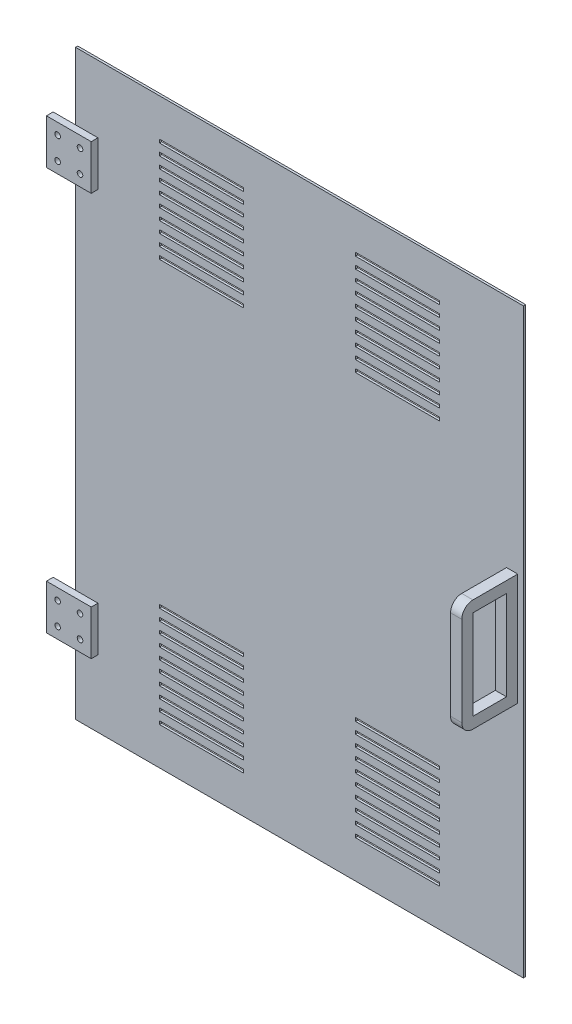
from build123d import *

# Parameters (mm, degrees)
SKETCH_1_W      = 400
SKETCH_1_H      = 520
SKETCH_1_W_2    = 75
SKETCH_1_H_2    = 3
EXTRUDE_1_DEPTH = 2
SKETCH_3_W      = 40
SKETCH_3_H      = 40
SKETCH_3_R      = 2.5
EXTRUDE_2_DEPTH = 6
SKETCH_4_W      = 30
SKETCH_4_H      = 80
EXTRUDE_3_DEPTH = 10


with BuildPart() as part:
    # Sketch 1 → Extrude 1 (new body)
    with BuildSketch(Plane.XY):
        with Locations((240, 300)):
            Rectangle(SKETCH_1_W, SKETCH_1_H)
        with Locations((327.5, 524.938797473)):
            Rectangle(SKETCH_1_W_2, SKETCH_1_H_2, mode=Mode.SUBTRACT)
        with Locations((152.5, 524.938797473)):
            Rectangle(SKETCH_1_W_2, SKETCH_1_H_2, mode=Mode.SUBTRACT)
        with Locations((152.5, 514.938797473)):
            Rectangle(SKETCH_1_W_2, SKETCH_1_H_2, mode=Mode.SUBTRACT)
        with Locations((327.5, 514.938797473)):
            Rectangle(SKETCH_1_W_2, SKETCH_1_H_2, mode=Mode.SUBTRACT)
        with Locations((152.5, 504.938797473)):
            Rectangle(SKETCH_1_W_2, SKETCH_1_H_2, mode=Mode.SUBTRACT)
        with Locations((327.5, 504.938797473)):
            Rectangle(SKETCH_1_W_2, SKETCH_1_H_2, mode=Mode.SUBTRACT)
        with Locations((152.5, 494.938797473)):
            Rectangle(SKETCH_1_W_2, SKETCH_1_H_2, mode=Mode.SUBTRACT)
        with Locations((327.5, 494.938797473)):
            Rectangle(SKETCH_1_W_2, SKETCH_1_H_2, mode=Mode.SUBTRACT)
        with Locations((152.5, 484.938797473)):
            Rectangle(SKETCH_1_W_2, SKETCH_1_H_2, mode=Mode.SUBTRACT)
        with Locations((327.5, 484.938797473)):
            Rectangle(SKETCH_1_W_2, SKETCH_1_H_2, mode=Mode.SUBTRACT)
        with Locations((152.5, 474.938797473)):
            Rectangle(SKETCH_1_W_2, SKETCH_1_H_2, mode=Mode.SUBTRACT)
        with Locations((327.5, 474.938797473)):
            Rectangle(SKETCH_1_W_2, SKETCH_1_H_2, mode=Mode.SUBTRACT)
        with Locations((152.5, 464.938797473)):
            Rectangle(SKETCH_1_W_2, SKETCH_1_H_2, mode=Mode.SUBTRACT)
        with Locations((327.5, 464.938797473)):
            Rectangle(SKETCH_1_W_2, SKETCH_1_H_2, mode=Mode.SUBTRACT)
        with Locations((152.5, 454.938797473)):
            Rectangle(SKETCH_1_W_2, SKETCH_1_H_2, mode=Mode.SUBTRACT)
        with Locations((327.5, 454.938797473)):
            Rectangle(SKETCH_1_W_2, SKETCH_1_H_2, mode=Mode.SUBTRACT)
        with Locations((152.5, 444.938797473)):
            Rectangle(SKETCH_1_W_2, SKETCH_1_H_2, mode=Mode.SUBTRACT)
        with Locations((327.5, 444.938797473)):
            Rectangle(SKETCH_1_W_2, SKETCH_1_H_2, mode=Mode.SUBTRACT)
        with Locations((152.5, 434.938797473)):
            Rectangle(SKETCH_1_W_2, SKETCH_1_H_2, mode=Mode.SUBTRACT)
        with Locations((327.5, 434.938797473)):
            Rectangle(SKETCH_1_W_2, SKETCH_1_H_2, mode=Mode.SUBTRACT)
        with Locations((327.5, 165.061202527)):
            Rectangle(SKETCH_1_W_2, SKETCH_1_H_2, mode=Mode.SUBTRACT)
        with Locations((152.5, 165.061202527)):
            Rectangle(SKETCH_1_W_2, SKETCH_1_H_2, mode=Mode.SUBTRACT)
        with Locations((327.5, 155.061202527)):
            Rectangle(SKETCH_1_W_2, SKETCH_1_H_2, mode=Mode.SUBTRACT)
        with Locations((152.5, 155.061202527)):
            Rectangle(SKETCH_1_W_2, SKETCH_1_H_2, mode=Mode.SUBTRACT)
        with Locations((327.5, 145.061202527)):
            Rectangle(SKETCH_1_W_2, SKETCH_1_H_2, mode=Mode.SUBTRACT)
        with Locations((152.5, 145.061202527)):
            Rectangle(SKETCH_1_W_2, SKETCH_1_H_2, mode=Mode.SUBTRACT)
        with Locations((327.5, 135.061202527)):
            Rectangle(SKETCH_1_W_2, SKETCH_1_H_2, mode=Mode.SUBTRACT)
        with Locations((152.5, 135.061202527)):
            Rectangle(SKETCH_1_W_2, SKETCH_1_H_2, mode=Mode.SUBTRACT)
        with Locations((327.5, 125.061202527)):
            Rectangle(SKETCH_1_W_2, SKETCH_1_H_2, mode=Mode.SUBTRACT)
        with Locations((152.5, 125.061202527)):
            Rectangle(SKETCH_1_W_2, SKETCH_1_H_2, mode=Mode.SUBTRACT)
        with Locations((327.5, 115.061202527)):
            Rectangle(SKETCH_1_W_2, SKETCH_1_H_2, mode=Mode.SUBTRACT)
        with Locations((152.5, 115.061202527)):
            Rectangle(SKETCH_1_W_2, SKETCH_1_H_2, mode=Mode.SUBTRACT)
        with Locations((327.5, 105.061202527)):
            Rectangle(SKETCH_1_W_2, SKETCH_1_H_2, mode=Mode.SUBTRACT)
        with Locations((152.5, 105.061202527)):
            Rectangle(SKETCH_1_W_2, SKETCH_1_H_2, mode=Mode.SUBTRACT)
        with Locations((327.5, 95.061202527)):
            Rectangle(SKETCH_1_W_2, SKETCH_1_H_2, mode=Mode.SUBTRACT)
        with Locations((152.5, 95.061202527)):
            Rectangle(SKETCH_1_W_2, SKETCH_1_H_2, mode=Mode.SUBTRACT)
        with Locations((327.5, 85.061202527)):
            Rectangle(SKETCH_1_W_2, SKETCH_1_H_2, mode=Mode.SUBTRACT)
        with Locations((152.5, 85.061202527)):
            Rectangle(SKETCH_1_W_2, SKETCH_1_H_2, mode=Mode.SUBTRACT)
        with Locations((327.5, 75.061202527)):
            Rectangle(SKETCH_1_W_2, SKETCH_1_H_2, mode=Mode.SUBTRACT)
        with Locations((152.5, 75.061202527)):
            Rectangle(SKETCH_1_W_2, SKETCH_1_H_2, mode=Mode.SUBTRACT)
    extrude(amount=-EXTRUDE_1_DEPTH)

    # Sketch 3 → Extrude 2 (add)
    # profile 1 of 2: a face of its own
    with BuildSketch(Plane.XY):
        with Locations((40, 480)):
            Rectangle(SKETCH_3_W, SKETCH_3_H)
        with Locations((50, 490)):
            Circle(SKETCH_3_R, mode=Mode.SUBTRACT)
        with Locations((50, 470)):
            Circle(SKETCH_3_R, mode=Mode.SUBTRACT)
        with Locations((30, 490)):
            Circle(SKETCH_3_R, mode=Mode.SUBTRACT)
        with Locations((30, 470)):
            Circle(SKETCH_3_R, mode=Mode.SUBTRACT)
    # profile 2 of 2: a face of its own
    with BuildSketch(Plane.XY):
        with Locations((40, 120)):
            Rectangle(SKETCH_3_W, SKETCH_3_H)
        with Locations(Location((30, 130, 0), (0, 0, 180))):
            Circle(SKETCH_3_R, mode=Mode.SUBTRACT)
        with Locations(Location((30, 110, 0), (0, 0, 180))):
            Circle(SKETCH_3_R, mode=Mode.SUBTRACT)
        with Locations(Location((50, 130, 0), (0, 0, 180))):
            Circle(SKETCH_3_R, mode=Mode.SUBTRACT)
        with Locations(Location((50, 110, 0), (0, 0, 180))):
            Circle(SKETCH_3_R, mode=Mode.SUBTRACT)
    extrude(amount=EXTRUDE_2_DEPTH)

    # Sketch 4 → Extrude 3 (add)
    with BuildSketch(Plane(origin=(425, 0, 0), x_dir=(0, 0, -1), z_dir=(1, 0, 0))):
        with BuildLine():
            Line((0, 350), (-40, 350))
            ThreePointArc((-40, 350), (-47.071067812, 347.071067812), (-50, 340))
            Line((-50, 340), (-50, 260))
            ThreePointArc((-50, 260), (-47.071067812, 252.928932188), (-40, 250))
            Line((-40, 250), (0, 250))
            Line((0, 250), (0, 350))
        make_face()
        with Locations((-25, 300)):
            Rectangle(SKETCH_4_W, SKETCH_4_H, mode=Mode.SUBTRACT)
    extrude(amount=EXTRUDE_3_DEPTH)


solid = part.part
